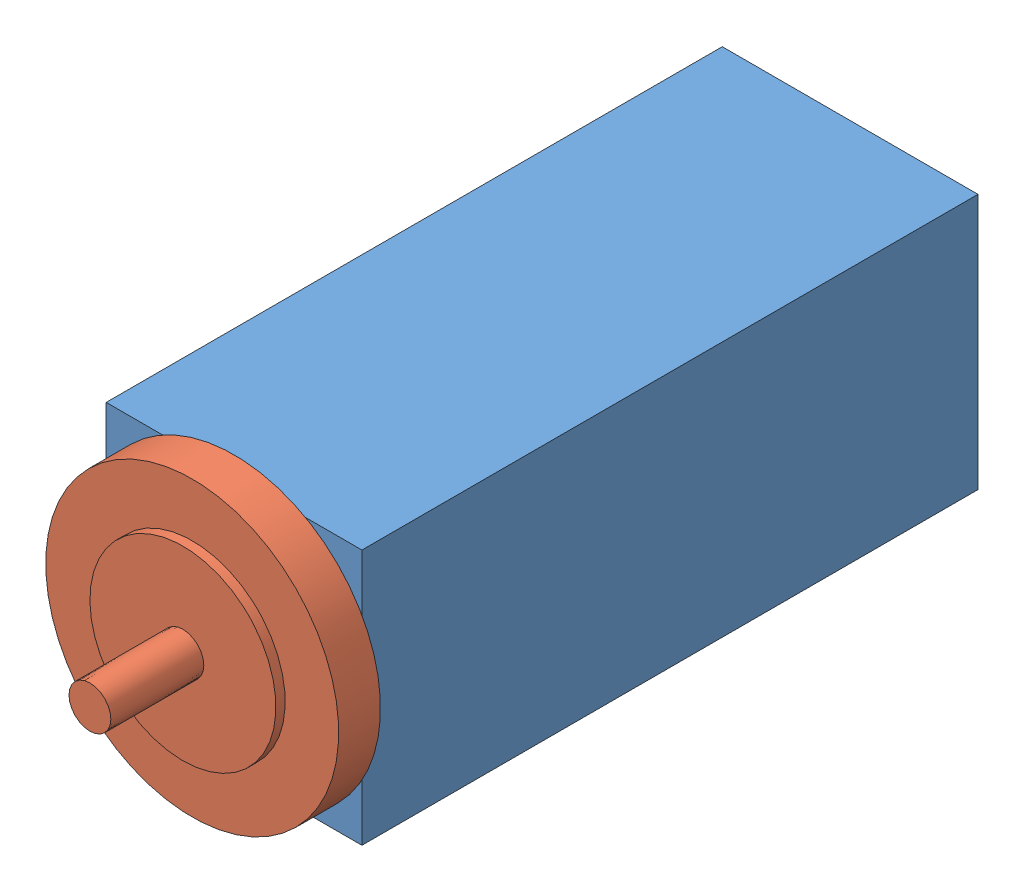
SolidWorks assembly moteur brushless.SLDASM, configuration Défaut (file format 10000). Lengths in mm.
Overall size (89.1 89.1 198.5).
3 component instances, 3 part files, 5 mates.
Components (placement in the parent):
- base moteur bsh-1: base moteur bsh.SLDPRT [Défaut] at (-56.1055 -40.0124 -66.25) size (55 55 132.5)
- 14k arbre brushless-1: 14k arbre brushless.SLDPRT [Défaut] at (-28.6055 -12.5124 66.25) x (0.707107 0.707107 0) z (0 0 1) size (63 63 31)
- piece adaptation arbres-1: piece adaptation arbres.SLDPRT [Défaut] at (-28.6055 -12.5124 82.25) x (0.157304 0.98755 0) z (0 0 1) size (23.2 23.2 50)
Mates (geometry in assembly coordinates):
- Coïncidente1: coincident anti-aligned: plane of base moteur bsh-1 through (-56.1055 14.9876 66.25) normal (0 0 1); plane of 14k arbre brushless-1 through (-28.6055 -12.5124 66.25) normal (0 0 -1)
- Coïncidente3: coincident aligned: line of base moteur bsh-1 through (-56.1055 14.9876 66.25) axis (0.707107 -0.707107 0); line of 14k arbre brushless-1 through (-50.8793 9.7615 66.25) axis (0.707107 -0.707107 0)
- Coïncidente4: coincident aligned: line of base moteur bsh-1 through (-1.1055 14.9876 66.25) axis (-0.707107 -0.707107 0); line of 14k arbre brushless-1 through (-6.3316 9.7615 66.25) axis (-0.707107 -0.707107 0)
- Coaxiale20: concentric aligned: cylinder of 14k arbre brushless-1 through (-28.6055 -12.5124 97.25) axis (0 0 -1) radius 4.5; cylinder of piece adaptation arbres-1 through (-28.6055 -12.5124 132.25) axis (0 0 -1) radius 4.6
- Distance17: distance = 5 mm anti-aligned: plane of 14k arbre brushless-1 through (-28.6055 -12.5124 77.25) normal (0 0 1); plane of piece adaptation arbres-1 through (-28.6055 -12.5124 82.25) normal (0 0 -1)
